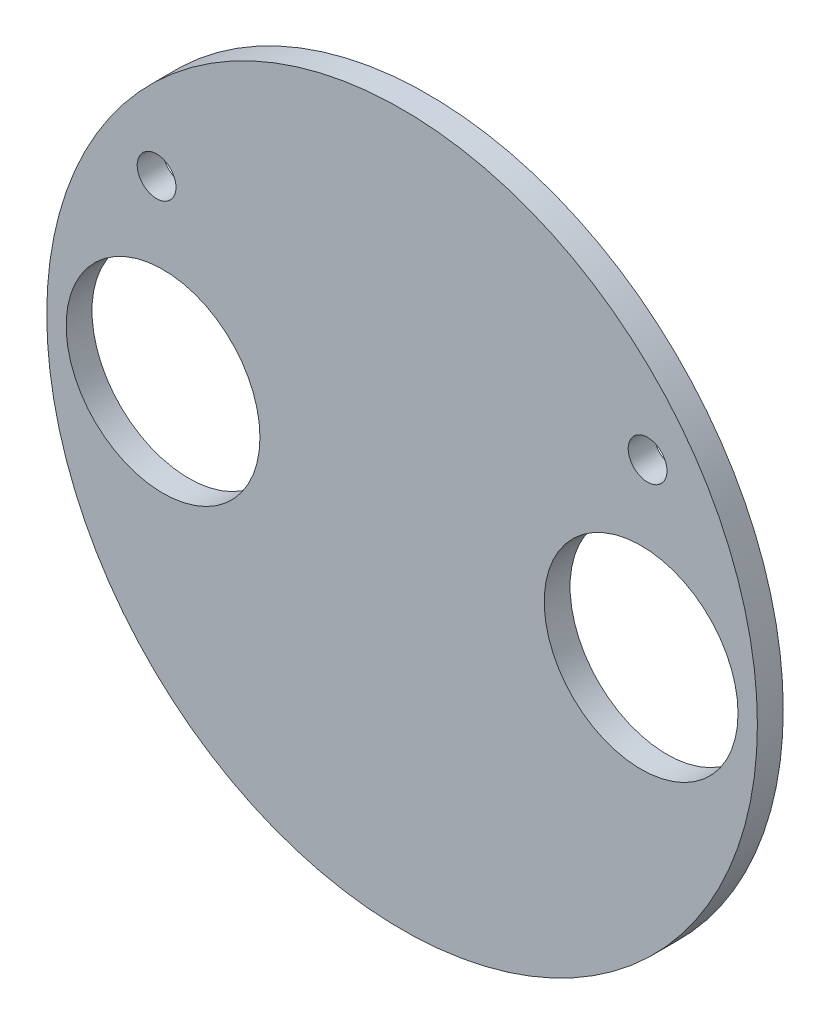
ISO-10303-21;
HEADER;
FILE_DESCRIPTION(('STEP AP214'),'2;1');
FILE_NAME('part.step','',(''),(''),'','','');
FILE_SCHEMA(('AUTOMOTIVE_DESIGN { 1 0 10303 214 1 1 1 1 }'));
ENDSEC;
DATA;
#1=APPLICATION_CONTEXT('core data for automotive mechanical design processes');
#2=APPLICATION_PROTOCOL_DEFINITION('international standard','automotive_design',2000,#1);
#3=PRODUCT_CONTEXT('',#1,'mechanical');
#4=PRODUCT('Part','Part','',(#3));
#5=PRODUCT_RELATED_PRODUCT_CATEGORY('part','',(#4));
#6=PRODUCT_DEFINITION_FORMATION('','',#4);
#7=PRODUCT_DEFINITION_CONTEXT('part definition',#1,'design');
#8=PRODUCT_DEFINITION('design','',#6,#7);
#9=PRODUCT_DEFINITION_SHAPE('','',#8);
#10=(LENGTH_UNIT() NAMED_UNIT(*) SI_UNIT(.MILLI.,.METRE.));
#11=(NAMED_UNIT(*) PLANE_ANGLE_UNIT() SI_UNIT($,.RADIAN.));
#12=(NAMED_UNIT(*) SI_UNIT($,.STERADIAN.) SOLID_ANGLE_UNIT());
#13=UNCERTAINTY_MEASURE_WITH_UNIT(LENGTH_MEASURE(1.E-05),#10,'distance_accuracy_value','');
#14=(GEOMETRIC_REPRESENTATION_CONTEXT(3) GLOBAL_UNCERTAINTY_ASSIGNED_CONTEXT((#13)) GLOBAL_UNIT_ASSIGNED_CONTEXT((#10,
#11,#12)) REPRESENTATION_CONTEXT('',''));
#15=CARTESIAN_POINT('',(0.,0.,0.));
#16=DIRECTION('',(0.,0.,1.));
#17=DIRECTION('',(1.,0.,0.));
#18=AXIS2_PLACEMENT_3D('',#15,#16,#17);
#19=CARTESIAN_POINT('',(0.,0.,2.));
#20=DIRECTION('',(0.,0.,-1.));
#21=DIRECTION('',(-1.,0.,0.));
#22=AXIS2_PLACEMENT_3D('',#19,#20,#21);
#23=CYLINDRICAL_SURFACE('',#22,27.5);
#24=CARTESIAN_POINT('',(0.,0.,2.));
#25=DIRECTION('',(0.,0.,1.));
#26=DIRECTION('',(1.,0.,0.));
#27=AXIS2_PLACEMENT_3D('',#24,#25,#26);
#28=CIRCLE('',#27,27.5);
#29=CARTESIAN_POINT('',(27.5,0.,2.));
#30=VERTEX_POINT('',#29);
#31=EDGE_CURVE('E10',#30,#30,#28,.T.);
#32=ORIENTED_EDGE('',*,*,#31,.F.);
#33=EDGE_LOOP('',(#32));
#34=FACE_BOUND('',#33,.T.);
#35=CARTESIAN_POINT('',(0.,0.,0.));
#36=DIRECTION('',(0.,0.,1.));
#37=DIRECTION('',(1.,0.,0.));
#38=AXIS2_PLACEMENT_3D('',#35,#36,#37);
#39=CIRCLE('',#38,27.5);
#40=CARTESIAN_POINT('',(27.5,0.,0.));
#41=VERTEX_POINT('',#40);
#42=EDGE_CURVE('E31',#41,#41,#39,.T.);
#43=ORIENTED_EDGE('',*,*,#42,.T.);
#44=EDGE_LOOP('',(#43));
#45=FACE_BOUND('',#44,.T.);
#46=ADVANCED_FACE('F25',(#34,#45),#23,.T.);
#47=CARTESIAN_POINT('',(0.,0.,2.));
#48=DIRECTION('',(0.,0.,1.));
#49=DIRECTION('',(1.,0.,0.));
#50=AXIS2_PLACEMENT_3D('',#47,#48,#49);
#51=PLANE('',#50);
#52=CARTESIAN_POINT('',(19.,13.5,2.));
#53=DIRECTION('',(0.,0.,1.));
#54=DIRECTION('',(1.,0.,0.));
#55=AXIS2_PLACEMENT_3D('',#52,#53,#54);
#56=CIRCLE('',#55,1.5);
#57=CARTESIAN_POINT('',(20.5,13.5,2.));
#58=VERTEX_POINT('',#57);
#59=EDGE_CURVE('E59',#58,#58,#56,.T.);
#60=ORIENTED_EDGE('',*,*,#59,.F.);
#61=EDGE_LOOP('',(#60));
#62=FACE_BOUND('',#61,.T.);
#63=CARTESIAN_POINT('',(18.5,0.,2.));
#64=DIRECTION('',(0.,0.,1.));
#65=DIRECTION('',(1.,0.,0.));
#66=AXIS2_PLACEMENT_3D('',#63,#64,#65);
#67=CIRCLE('',#66,7.5);
#68=CARTESIAN_POINT('',(26.,0.,2.));
#69=VERTEX_POINT('',#68);
#70=EDGE_CURVE('E53',#69,#69,#67,.T.);
#71=ORIENTED_EDGE('',*,*,#70,.F.);
#72=EDGE_LOOP('',(#71));
#73=FACE_BOUND('',#72,.T.);
#74=CARTESIAN_POINT('',(-19.,13.5,2.));
#75=DIRECTION('',(0.,0.,1.));
#76=DIRECTION('',(1.,0.,0.));
#77=AXIS2_PLACEMENT_3D('',#74,#75,#76);
#78=CIRCLE('',#77,1.5);
#79=CARTESIAN_POINT('',(-17.5,13.5,2.));
#80=VERTEX_POINT('',#79);
#81=EDGE_CURVE('E47',#80,#80,#78,.T.);
#82=ORIENTED_EDGE('',*,*,#81,.F.);
#83=EDGE_LOOP('',(#82));
#84=FACE_BOUND('',#83,.T.);
#85=CARTESIAN_POINT('',(-18.5,0.,2.));
#86=DIRECTION('',(0.,0.,1.));
#87=DIRECTION('',(1.,0.,0.));
#88=AXIS2_PLACEMENT_3D('',#85,#86,#87);
#89=CIRCLE('',#88,7.5);
#90=CARTESIAN_POINT('',(-11.,0.,2.));
#91=VERTEX_POINT('',#90);
#92=EDGE_CURVE('E39',#91,#91,#89,.T.);
#93=ORIENTED_EDGE('',*,*,#92,.F.);
#94=EDGE_LOOP('',(#93));
#95=FACE_BOUND('',#94,.T.);
#96=ORIENTED_EDGE('',*,*,#31,.T.);
#97=EDGE_LOOP('',(#96));
#98=FACE_BOUND('',#97,.T.);
#99=ADVANCED_FACE('F65',(#62,#73,#84,#95,#98),#51,.T.);
#100=CARTESIAN_POINT('',(0.,0.,0.));
#101=DIRECTION('',(0.,0.,1.));
#102=DIRECTION('',(1.,0.,0.));
#103=AXIS2_PLACEMENT_3D('',#100,#101,#102);
#104=PLANE('',#103);
#105=CARTESIAN_POINT('',(19.,13.5,0.));
#106=DIRECTION('',(0.,0.,1.));
#107=DIRECTION('',(1.,0.,0.));
#108=AXIS2_PLACEMENT_3D('',#105,#106,#107);
#109=CIRCLE('',#108,1.5);
#110=CARTESIAN_POINT('',(20.5,13.5,0.));
#111=VERTEX_POINT('',#110);
#112=EDGE_CURVE('E56',#111,#111,#109,.T.);
#113=ORIENTED_EDGE('',*,*,#112,.T.);
#114=EDGE_LOOP('',(#113));
#115=FACE_BOUND('',#114,.T.);
#116=CARTESIAN_POINT('',(18.5,0.,0.));
#117=DIRECTION('',(0.,0.,1.));
#118=DIRECTION('',(1.,0.,0.));
#119=AXIS2_PLACEMENT_3D('',#116,#117,#118);
#120=CIRCLE('',#119,7.5);
#121=CARTESIAN_POINT('',(26.,0.,0.));
#122=VERTEX_POINT('',#121);
#123=EDGE_CURVE('E50',#122,#122,#120,.T.);
#124=ORIENTED_EDGE('',*,*,#123,.T.);
#125=EDGE_LOOP('',(#124));
#126=FACE_BOUND('',#125,.T.);
#127=CARTESIAN_POINT('',(-19.,13.5,0.));
#128=DIRECTION('',(0.,0.,1.));
#129=DIRECTION('',(1.,0.,0.));
#130=AXIS2_PLACEMENT_3D('',#127,#128,#129);
#131=CIRCLE('',#130,1.5);
#132=CARTESIAN_POINT('',(-17.5,13.5,0.));
#133=VERTEX_POINT('',#132);
#134=EDGE_CURVE('E44',#133,#133,#131,.T.);
#135=ORIENTED_EDGE('',*,*,#134,.T.);
#136=EDGE_LOOP('',(#135));
#137=FACE_BOUND('',#136,.T.);
#138=CARTESIAN_POINT('',(-18.5,0.,0.));
#139=DIRECTION('',(0.,0.,1.));
#140=DIRECTION('',(1.,0.,0.));
#141=AXIS2_PLACEMENT_3D('',#138,#139,#140);
#142=CIRCLE('',#141,7.5);
#143=CARTESIAN_POINT('',(-11.,0.,0.));
#144=VERTEX_POINT('',#143);
#145=EDGE_CURVE('E35',#144,#144,#142,.T.);
#146=ORIENTED_EDGE('',*,*,#145,.T.);
#147=EDGE_LOOP('',(#146));
#148=FACE_BOUND('',#147,.T.);
#149=ORIENTED_EDGE('',*,*,#42,.F.);
#150=EDGE_LOOP('',(#149));
#151=FACE_BOUND('',#150,.T.);
#152=ADVANCED_FACE('F68',(#115,#126,#137,#148,#151),#104,.F.);
#153=CARTESIAN_POINT('',(-18.5,0.,0.));
#154=DIRECTION('',(0.,0.,1.));
#155=DIRECTION('',(1.,0.,0.));
#156=AXIS2_PLACEMENT_3D('',#153,#154,#155);
#157=CYLINDRICAL_SURFACE('',#156,7.5);
#158=ORIENTED_EDGE('',*,*,#145,.F.);
#159=EDGE_LOOP('',(#158));
#160=FACE_BOUND('',#159,.T.);
#161=ORIENTED_EDGE('',*,*,#92,.T.);
#162=EDGE_LOOP('',(#161));
#163=FACE_BOUND('',#162,.T.);
#164=ADVANCED_FACE('F75',(#160,#163),#157,.F.);
#165=CARTESIAN_POINT('',(-19.,13.5,0.));
#166=DIRECTION('',(0.,0.,1.));
#167=DIRECTION('',(1.,0.,0.));
#168=AXIS2_PLACEMENT_3D('',#165,#166,#167);
#169=CYLINDRICAL_SURFACE('',#168,1.5);
#170=ORIENTED_EDGE('',*,*,#134,.F.);
#171=EDGE_LOOP('',(#170));
#172=FACE_BOUND('',#171,.T.);
#173=ORIENTED_EDGE('',*,*,#81,.T.);
#174=EDGE_LOOP('',(#173));
#175=FACE_BOUND('',#174,.T.);
#176=ADVANCED_FACE('F77',(#172,#175),#169,.F.);
#177=CARTESIAN_POINT('',(18.5,0.,0.));
#178=DIRECTION('',(0.,0.,1.));
#179=DIRECTION('',(1.,0.,0.));
#180=AXIS2_PLACEMENT_3D('',#177,#178,#179);
#181=CYLINDRICAL_SURFACE('',#180,7.5);
#182=ORIENTED_EDGE('',*,*,#123,.F.);
#183=EDGE_LOOP('',(#182));
#184=FACE_BOUND('',#183,.T.);
#185=ORIENTED_EDGE('',*,*,#70,.T.);
#186=EDGE_LOOP('',(#185));
#187=FACE_BOUND('',#186,.T.);
#188=ADVANCED_FACE('F84',(#184,#187),#181,.F.);
#189=CARTESIAN_POINT('',(19.,13.5,0.));
#190=DIRECTION('',(0.,0.,1.));
#191=DIRECTION('',(1.,0.,0.));
#192=AXIS2_PLACEMENT_3D('',#189,#190,#191);
#193=CYLINDRICAL_SURFACE('',#192,1.5);
#194=ORIENTED_EDGE('',*,*,#112,.F.);
#195=EDGE_LOOP('',(#194));
#196=FACE_BOUND('',#195,.T.);
#197=ORIENTED_EDGE('',*,*,#59,.T.);
#198=EDGE_LOOP('',(#197));
#199=FACE_BOUND('',#198,.T.);
#200=ADVANCED_FACE('F63',(#196,#199),#193,.F.);
#201=CLOSED_SHELL('',(#46,#99,#152,#164,#176,#188,#200));
#202=MANIFOLD_SOLID_BREP('B2',#201);
#203=ADVANCED_BREP_SHAPE_REPRESENTATION('',(#18,#202),#14);
#204=SHAPE_DEFINITION_REPRESENTATION(#9,#203);
ENDSEC;
END-ISO-10303-21;
